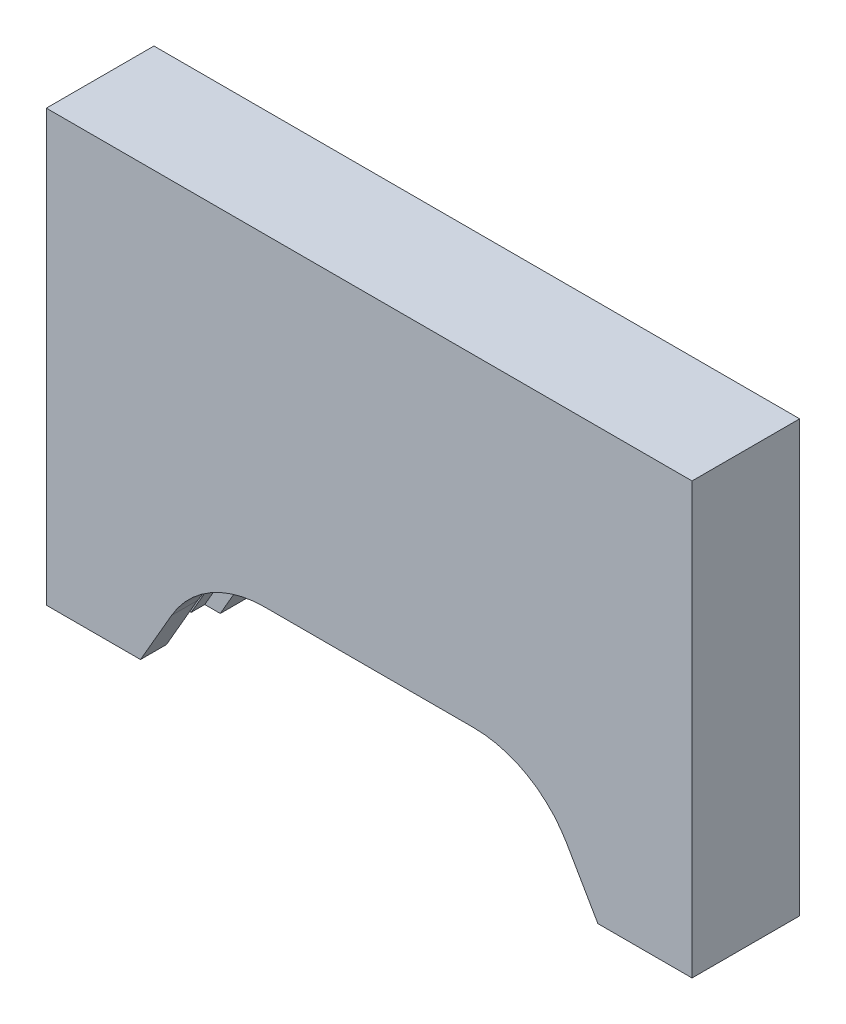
ISO-10303-21;
HEADER;
FILE_DESCRIPTION(('STEP AP214'),'2;1');
FILE_NAME('part.step','',(''),(''),'','','');
FILE_SCHEMA(('AUTOMOTIVE_DESIGN { 1 0 10303 214 1 1 1 1 }'));
ENDSEC;
DATA;
#1=APPLICATION_CONTEXT('core data for automotive mechanical design processes');
#2=APPLICATION_PROTOCOL_DEFINITION('international standard','automotive_design',2000,#1);
#3=PRODUCT_CONTEXT('',#1,'mechanical');
#4=PRODUCT('Part','Part','',(#3));
#5=PRODUCT_RELATED_PRODUCT_CATEGORY('part','',(#4));
#6=PRODUCT_DEFINITION_FORMATION('','',#4);
#7=PRODUCT_DEFINITION_CONTEXT('part definition',#1,'design');
#8=PRODUCT_DEFINITION('design','',#6,#7);
#9=PRODUCT_DEFINITION_SHAPE('','',#8);
#10=(LENGTH_UNIT() NAMED_UNIT(*) SI_UNIT(.MILLI.,.METRE.));
#11=(NAMED_UNIT(*) PLANE_ANGLE_UNIT() SI_UNIT($,.RADIAN.));
#12=(NAMED_UNIT(*) SI_UNIT($,.STERADIAN.) SOLID_ANGLE_UNIT());
#13=UNCERTAINTY_MEASURE_WITH_UNIT(LENGTH_MEASURE(1.E-05),#10,'distance_accuracy_value','');
#14=(GEOMETRIC_REPRESENTATION_CONTEXT(3) GLOBAL_UNCERTAINTY_ASSIGNED_CONTEXT((#13)) GLOBAL_UNIT_ASSIGNED_CONTEXT((#10,
#11,#12)) REPRESENTATION_CONTEXT('',''));
#15=CARTESIAN_POINT('',(0.,0.,0.));
#16=DIRECTION('',(0.,0.,1.));
#17=DIRECTION('',(1.,0.,0.));
#18=AXIS2_PLACEMENT_3D('',#15,#16,#17);
#19=CARTESIAN_POINT('',(-53.975,-50.8,288.293488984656));
#20=DIRECTION('',(-0.86602540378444,0.499999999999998,0.));
#21=DIRECTION('',(-0.499999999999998,-0.86602540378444,0.));
#22=AXIS2_PLACEMENT_3D('',#19,#20,#21);
#23=PLANE('',#22);
#24=DIRECTION('',(0.,0.,-1.));
#25=VECTOR('',#24,1.);
#26=CARTESIAN_POINT('',(-53.975,-50.8,288.293488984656));
#27=LINE('',#26,#25);
#28=CARTESIAN_POINT('',(-53.975,-50.8,25.4));
#29=VERTEX_POINT('',#28);
#30=CARTESIAN_POINT('',(-53.975,-50.8,19.2706454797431));
#31=VERTEX_POINT('',#30);
#32=EDGE_CURVE('E557',#29,#31,#27,.T.);
#33=ORIENTED_EDGE('',*,*,#32,.T.);
#34=DIRECTION('',(0.499999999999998,0.86602540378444,0.));
#35=VECTOR('',#34,1.);
#36=CARTESIAN_POINT('',(-53.975,-50.8,19.2706454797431));
#37=LINE('',#36,#35);
#38=CARTESIAN_POINT('',(-46.6426515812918,-38.1000000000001,19.2706454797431));
#39=VERTEX_POINT('',#38);
#40=EDGE_CURVE('E318',#31,#39,#37,.T.);
#41=ORIENTED_EDGE('',*,*,#40,.T.);
#42=DIRECTION('',(0.,0.,-1.));
#43=VECTOR('',#42,1.);
#44=CARTESIAN_POINT('',(-46.6426515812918,-38.1,288.293488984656));
#45=LINE('',#44,#43);
#46=CARTESIAN_POINT('',(-46.6426515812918,-38.1,25.4));
#47=VERTEX_POINT('',#46);
#48=EDGE_CURVE('E563',#47,#39,#45,.T.);
#49=ORIENTED_EDGE('',*,*,#48,.F.);
#50=DIRECTION('',(0.499999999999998,0.86602540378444,0.));
#51=VECTOR('',#50,1.);
#52=CARTESIAN_POINT('',(-18.4842047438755,10.6718605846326,25.4));
#53=LINE('',#52,#51);
#54=EDGE_CURVE('E63',#29,#47,#53,.T.);
#55=ORIENTED_EDGE('',*,*,#54,.F.);
#56=EDGE_LOOP('',(#33,#41,#49,#55));
#57=FACE_BOUND('',#56,.T.);
#58=ADVANCED_FACE('F39',(#57),#23,.F.);
#59=CARTESIAN_POINT('',(-24.645606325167,-50.8,288.293488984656));
#60=DIRECTION('',(0.,0.,-1.));
#61=DIRECTION('',(-1.,0.,0.));
#62=AXIS2_PLACEMENT_3D('',#59,#60,#61);
#63=CYLINDRICAL_SURFACE('',#62,25.4);
#64=ORIENTED_EDGE('',*,*,#48,.T.);
#65=CARTESIAN_POINT('',(-24.645606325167,-50.8,19.2706454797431));
#66=DIRECTION('',(0.,0.,1.));
#67=DIRECTION('',(1.,0.,0.));
#68=AXIS2_PLACEMENT_3D('',#65,#66,#67);
#69=CIRCLE('',#68,25.4);
#70=CARTESIAN_POINT('',(-24.6456063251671,-25.4,19.2706454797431));
#71=VERTEX_POINT('',#70);
#72=EDGE_CURVE('E791',#39,#71,#69,.F.);
#73=ORIENTED_EDGE('',*,*,#72,.T.);
#74=DIRECTION('',(0.,0.,-1.));
#75=VECTOR('',#74,1.);
#76=CARTESIAN_POINT('',(-24.645606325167,-25.4,288.293488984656));
#77=LINE('',#76,#75);
#78=CARTESIAN_POINT('',(-24.645606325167,-25.4,25.4));
#79=VERTEX_POINT('',#78);
#80=EDGE_CURVE('E583',#79,#71,#77,.T.);
#81=ORIENTED_EDGE('',*,*,#80,.F.);
#82=CARTESIAN_POINT('',(-24.645606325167,-50.8,25.4));
#83=DIRECTION('',(0.,0.,-1.));
#84=DIRECTION('',(-1.,0.,0.));
#85=AXIS2_PLACEMENT_3D('',#82,#83,#84);
#86=CIRCLE('',#85,25.4);
#87=EDGE_CURVE('E608',#47,#79,#86,.T.);
#88=ORIENTED_EDGE('',*,*,#87,.F.);
#89=EDGE_LOOP('',(#64,#73,#81,#88));
#90=FACE_BOUND('',#89,.T.);
#91=ADVANCED_FACE('F1075',(#90),#63,.F.);
#92=CARTESIAN_POINT('',(-24.645606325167,-25.4,288.293488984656));
#93=DIRECTION('',(0.,1.,0.));
#94=DIRECTION('',(0.,0.,1.));
#95=AXIS2_PLACEMENT_3D('',#92,#93,#94);
#96=PLANE('',#95);
#97=ORIENTED_EDGE('',*,*,#80,.T.);
#98=DIRECTION('',(1.,0.,0.));
#99=VECTOR('',#98,1.);
#100=CARTESIAN_POINT('',(-24.645606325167,-25.4,19.2706454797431));
#101=LINE('',#100,#99);
#102=CARTESIAN_POINT('',(24.645606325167,-25.4,19.2706454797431));
#103=VERTEX_POINT('',#102);
#104=EDGE_CURVE('E337',#71,#103,#101,.T.);
#105=ORIENTED_EDGE('',*,*,#104,.T.);
#106=DIRECTION('',(0.,0.,-1.));
#107=VECTOR('',#106,1.);
#108=CARTESIAN_POINT('',(24.645606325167,-25.4,288.293488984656));
#109=LINE('',#108,#107);
#110=CARTESIAN_POINT('',(24.645606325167,-25.4,25.4));
#111=VERTEX_POINT('',#110);
#112=EDGE_CURVE('E588',#111,#103,#109,.T.);
#113=ORIENTED_EDGE('',*,*,#112,.F.);
#114=DIRECTION('',(1.,0.,0.));
#115=VECTOR('',#114,1.);
#116=CARTESIAN_POINT('',(0.,-25.4,25.4));
#117=LINE('',#116,#115);
#118=EDGE_CURVE('E623',#79,#111,#117,.T.);
#119=ORIENTED_EDGE('',*,*,#118,.F.);
#120=EDGE_LOOP('',(#97,#105,#113,#119));
#121=FACE_BOUND('',#120,.T.);
#122=ADVANCED_FACE('F1085',(#121),#96,.F.);
#123=CARTESIAN_POINT('',(24.645606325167,-50.8,288.293488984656));
#124=DIRECTION('',(0.,0.,-1.));
#125=DIRECTION('',(-1.,0.,0.));
#126=AXIS2_PLACEMENT_3D('',#123,#124,#125);
#127=CYLINDRICAL_SURFACE('',#126,25.4);
#128=ORIENTED_EDGE('',*,*,#112,.T.);
#129=CARTESIAN_POINT('',(24.645606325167,-50.8,19.2706454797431));
#130=DIRECTION('',(0.,0.,1.));
#131=DIRECTION('',(1.,0.,0.));
#132=AXIS2_PLACEMENT_3D('',#129,#130,#131);
#133=CIRCLE('',#132,25.4);
#134=CARTESIAN_POINT('',(46.6426515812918,-38.1,19.2706454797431));
#135=VERTEX_POINT('',#134);
#136=EDGE_CURVE('E822',#103,#135,#133,.F.);
#137=ORIENTED_EDGE('',*,*,#136,.T.);
#138=DIRECTION('',(0.,0.,-1.));
#139=VECTOR('',#138,1.);
#140=CARTESIAN_POINT('',(46.6426515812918,-38.1,288.293488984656));
#141=LINE('',#140,#139);
#142=CARTESIAN_POINT('',(46.6426515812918,-38.1,25.4));
#143=VERTEX_POINT('',#142);
#144=EDGE_CURVE('E477',#143,#135,#141,.T.);
#145=ORIENTED_EDGE('',*,*,#144,.F.);
#146=CARTESIAN_POINT('',(24.645606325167,-50.8,25.4));
#147=DIRECTION('',(0.,0.,-1.));
#148=DIRECTION('',(-1.,0.,0.));
#149=AXIS2_PLACEMENT_3D('',#146,#147,#148);
#150=CIRCLE('',#149,25.4);
#151=EDGE_CURVE('E620',#111,#143,#150,.T.);
#152=ORIENTED_EDGE('',*,*,#151,.F.);
#153=EDGE_LOOP('',(#128,#137,#145,#152));
#154=FACE_BOUND('',#153,.T.);
#155=ADVANCED_FACE('F820',(#154),#127,.F.);
#156=CARTESIAN_POINT('',(46.6426515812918,-38.1,288.293488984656));
#157=DIRECTION('',(0.86602540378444,0.499999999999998,0.));
#158=DIRECTION('',(-0.499999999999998,0.86602540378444,0.));
#159=AXIS2_PLACEMENT_3D('',#156,#157,#158);
#160=PLANE('',#159);
#161=ORIENTED_EDGE('',*,*,#144,.T.);
#162=DIRECTION('',(0.499999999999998,-0.86602540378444,0.));
#163=VECTOR('',#162,1.);
#164=CARTESIAN_POINT('',(46.6426515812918,-38.1,19.2706454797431));
#165=LINE('',#164,#163);
#166=CARTESIAN_POINT('',(53.975,-50.8,19.2706454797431));
#167=VERTEX_POINT('',#166);
#168=EDGE_CURVE('E792',#135,#167,#165,.T.);
#169=ORIENTED_EDGE('',*,*,#168,.T.);
#170=DIRECTION('',(0.,0.,-1.));
#171=VECTOR('',#170,1.);
#172=CARTESIAN_POINT('',(53.975,-50.8,288.293488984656));
#173=LINE('',#172,#171);
#174=CARTESIAN_POINT('',(53.975,-50.8,25.4));
#175=VERTEX_POINT('',#174);
#176=EDGE_CURVE('E472',#175,#167,#173,.T.);
#177=ORIENTED_EDGE('',*,*,#176,.F.);
#178=DIRECTION('',(0.499999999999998,-0.86602540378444,0.));
#179=VECTOR('',#178,1.);
#180=CARTESIAN_POINT('',(18.4842047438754,10.6718605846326,25.4));
#181=LINE('',#180,#179);
#182=EDGE_CURVE('E561',#143,#175,#181,.T.);
#183=ORIENTED_EDGE('',*,*,#182,.F.);
#184=EDGE_LOOP('',(#161,#169,#177,#183));
#185=FACE_BOUND('',#184,.T.);
#186=ADVANCED_FACE('F816',(#185),#160,.F.);
#187=CARTESIAN_POINT('',(-76.2,-50.8,25.4));
#188=DIRECTION('',(0.,1.,0.));
#189=DIRECTION('',(0.,0.,1.));
#190=AXIS2_PLACEMENT_3D('',#187,#188,#189);
#191=PLANE('',#190);
#192=DIRECTION('',(0.,0.,1.));
#193=VECTOR('',#192,1.);
#194=CARTESIAN_POINT('',(-57.6411742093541,-50.8,25.4));
#195=LINE('',#194,#193);
#196=CARTESIAN_POINT('',(-57.6411742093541,-50.8,16.0956454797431));
#197=VERTEX_POINT('',#196);
#198=CARTESIAN_POINT('',(-57.6411742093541,-50.8,19.2706454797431));
#199=VERTEX_POINT('',#198);
#200=EDGE_CURVE('E12',#197,#199,#195,.T.);
#201=ORIENTED_EDGE('',*,*,#200,.T.);
#202=DIRECTION('',(1.,0.,0.));
#203=VECTOR('',#202,1.);
#204=CARTESIAN_POINT('',(-76.2,-50.8,19.2706454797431));
#205=LINE('',#204,#203);
#206=EDGE_CURVE('E323',#199,#31,#205,.T.);
#207=ORIENTED_EDGE('',*,*,#206,.T.);
#208=ORIENTED_EDGE('',*,*,#32,.F.);
#209=DIRECTION('',(1.,0.,0.));
#210=VECTOR('',#209,1.);
#211=CARTESIAN_POINT('',(-76.2,-50.8,25.4));
#212=LINE('',#211,#210);
#213=CARTESIAN_POINT('',(-76.2,-50.8,25.4));
#214=VERTEX_POINT('',#213);
#215=EDGE_CURVE('E628',#214,#29,#212,.T.);
#216=ORIENTED_EDGE('',*,*,#215,.F.);
#217=DIRECTION('',(0.,0.,-1.));
#218=VECTOR('',#217,1.);
#219=CARTESIAN_POINT('',(-76.2,-50.8,25.4));
#220=LINE('',#219,#218);
#221=CARTESIAN_POINT('',(-76.2,-50.8,0.));
#222=VERTEX_POINT('',#221);
#223=EDGE_CURVE('E666',#214,#222,#220,.T.);
#224=ORIENTED_EDGE('',*,*,#223,.T.);
#225=DIRECTION('',(1.,0.,0.));
#226=VECTOR('',#225,1.);
#227=CARTESIAN_POINT('',(-76.2,-50.8,0.));
#228=LINE('',#227,#226);
#229=CARTESIAN_POINT('',(-53.975,-50.8,0.));
#230=VERTEX_POINT('',#229);
#231=EDGE_CURVE('E538',#222,#230,#228,.T.);
#232=ORIENTED_EDGE('',*,*,#231,.T.);
#233=CARTESIAN_POINT('',(-53.975,-50.8,6.57064547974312));
#234=VERTEX_POINT('',#233);
#235=EDGE_CURVE('E562',#234,#230,#27,.T.);
#236=ORIENTED_EDGE('',*,*,#235,.F.);
#237=DIRECTION('',(-1.,0.,0.));
#238=VECTOR('',#237,1.);
#239=CARTESIAN_POINT('',(-76.2,-50.8,6.5706454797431));
#240=LINE('',#239,#238);
#241=CARTESIAN_POINT('',(-57.6411742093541,-50.8,6.5706454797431));
#242=VERTEX_POINT('',#241);
#243=EDGE_CURVE('E324',#234,#242,#240,.T.);
#244=ORIENTED_EDGE('',*,*,#243,.T.);
#245=DIRECTION('',(0.,0.,1.));
#246=VECTOR('',#245,1.);
#247=CARTESIAN_POINT('',(-57.6411742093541,-50.8,25.4));
#248=LINE('',#247,#246);
#249=CARTESIAN_POINT('',(-57.6411742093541,-50.8,9.7456454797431));
#250=VERTEX_POINT('',#249);
#251=EDGE_CURVE('E769',#242,#250,#248,.T.);
#252=ORIENTED_EDGE('',*,*,#251,.T.);
#253=CARTESIAN_POINT('',(-57.6411742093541,-50.8,12.9206454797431));
#254=DIRECTION('',(0.,1.,0.));
#255=DIRECTION('',(1.,0.,0.));
#256=AXIS2_PLACEMENT_3D('',#253,#254,#255);
#257=ELLIPSE('',#256,3.66617420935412,3.175);
#258=EDGE_CURVE('E48',#250,#197,#257,.T.);
#259=ORIENTED_EDGE('',*,*,#258,.T.);
#260=EDGE_LOOP('',(#201,#207,#208,#216,#224,#232,#236,#244,#252,#259));
#261=FACE_BOUND('',#260,.T.);
#262=ADVANCED_FACE('F779',(#261),#191,.F.);
#263=CARTESIAN_POINT('',(76.2,-50.8,25.4));
#264=DIRECTION('',(-1.,0.,0.));
#265=DIRECTION('',(0.,0.,1.));
#266=AXIS2_PLACEMENT_3D('',#263,#264,#265);
#267=PLANE('',#266);
#268=DIRECTION('',(0.,1.,0.));
#269=VECTOR('',#268,1.);
#270=CARTESIAN_POINT('',(76.2,-50.8,0.));
#271=LINE('',#270,#269);
#272=CARTESIAN_POINT('',(76.2,-50.8,0.));
#273=VERTEX_POINT('',#272);
#274=CARTESIAN_POINT('',(76.2,50.8,0.));
#275=VERTEX_POINT('',#274);
#276=EDGE_CURVE('E607',#273,#275,#271,.T.);
#277=ORIENTED_EDGE('',*,*,#276,.T.);
#278=DIRECTION('',(0.,0.,-1.));
#279=VECTOR('',#278,1.);
#280=CARTESIAN_POINT('',(76.2,50.8,25.4));
#281=LINE('',#280,#279);
#282=CARTESIAN_POINT('',(76.2,50.8,25.4));
#283=VERTEX_POINT('',#282);
#284=EDGE_CURVE('E520',#283,#275,#281,.T.);
#285=ORIENTED_EDGE('',*,*,#284,.F.);
#286=DIRECTION('',(0.,1.,0.));
#287=VECTOR('',#286,1.);
#288=CARTESIAN_POINT('',(76.2,-50.8,25.4));
#289=LINE('',#288,#287);
#290=CARTESIAN_POINT('',(76.2,-50.8,25.4));
#291=VERTEX_POINT('',#290);
#292=EDGE_CURVE('E542',#291,#283,#289,.T.);
#293=ORIENTED_EDGE('',*,*,#292,.F.);
#294=DIRECTION('',(0.,0.,-1.));
#295=VECTOR('',#294,1.);
#296=CARTESIAN_POINT('',(76.2,-50.8,25.4));
#297=LINE('',#296,#295);
#298=EDGE_CURVE('E547',#291,#273,#297,.T.);
#299=ORIENTED_EDGE('',*,*,#298,.T.);
#300=EDGE_LOOP('',(#277,#285,#293,#299));
#301=FACE_BOUND('',#300,.T.);
#302=ADVANCED_FACE('F41',(#301),#267,.F.);
#303=CARTESIAN_POINT('',(-76.2,50.8,25.4));
#304=DIRECTION('',(0.,-1.,0.));
#305=DIRECTION('',(0.,0.,-1.));
#306=AXIS2_PLACEMENT_3D('',#303,#304,#305);
#307=PLANE('',#306);
#308=DIRECTION('',(-1.,0.,0.));
#309=VECTOR('',#308,1.);
#310=CARTESIAN_POINT('',(-76.2,50.8,0.));
#311=LINE('',#310,#309);
#312=CARTESIAN_POINT('',(-76.2,50.8,0.));
#313=VERTEX_POINT('',#312);
#314=EDGE_CURVE('E639',#275,#313,#311,.T.);
#315=ORIENTED_EDGE('',*,*,#314,.T.);
#316=DIRECTION('',(0.,0.,-1.));
#317=VECTOR('',#316,1.);
#318=CARTESIAN_POINT('',(-76.2,50.8,25.4));
#319=LINE('',#318,#317);
#320=CARTESIAN_POINT('',(-76.2,50.8,25.4));
#321=VERTEX_POINT('',#320);
#322=EDGE_CURVE('E672',#321,#313,#319,.T.);
#323=ORIENTED_EDGE('',*,*,#322,.F.);
#324=DIRECTION('',(-1.,0.,0.));
#325=VECTOR('',#324,1.);
#326=CARTESIAN_POINT('',(-76.2,50.8,25.4));
#327=LINE('',#326,#325);
#328=EDGE_CURVE('E671',#283,#321,#327,.T.);
#329=ORIENTED_EDGE('',*,*,#328,.F.);
#330=ORIENTED_EDGE('',*,*,#284,.T.);
#331=EDGE_LOOP('',(#315,#323,#329,#330));
#332=FACE_BOUND('',#331,.T.);
#333=ADVANCED_FACE('F670',(#332),#307,.F.);
#334=CARTESIAN_POINT('',(-76.2,-50.8,25.4));
#335=DIRECTION('',(1.,0.,0.));
#336=DIRECTION('',(0.,0.,-1.));
#337=AXIS2_PLACEMENT_3D('',#334,#335,#336);
#338=PLANE('',#337);
#339=DIRECTION('',(0.,-1.,0.));
#340=VECTOR('',#339,1.);
#341=CARTESIAN_POINT('',(-76.2,-50.8,0.));
#342=LINE('',#341,#340);
#343=EDGE_CURVE('E544',#313,#222,#342,.T.);
#344=ORIENTED_EDGE('',*,*,#343,.T.);
#345=ORIENTED_EDGE('',*,*,#223,.F.);
#346=DIRECTION('',(0.,-1.,0.));
#347=VECTOR('',#346,1.);
#348=CARTESIAN_POINT('',(-76.2,-50.8,25.4));
#349=LINE('',#348,#347);
#350=EDGE_CURVE('E634',#321,#214,#349,.T.);
#351=ORIENTED_EDGE('',*,*,#350,.F.);
#352=ORIENTED_EDGE('',*,*,#322,.T.);
#353=EDGE_LOOP('',(#344,#345,#351,#352));
#354=FACE_BOUND('',#353,.T.);
#355=ADVANCED_FACE('F802',(#354),#338,.F.);
#356=ORIENTED_EDGE('',*,*,#176,.T.);
#357=DIRECTION('',(1.,0.,0.));
#358=VECTOR('',#357,1.);
#359=CARTESIAN_POINT('',(-76.2,-50.8,19.2706454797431));
#360=LINE('',#359,#358);
#361=CARTESIAN_POINT('',(57.6411742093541,-50.8,19.2706454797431));
#362=VERTEX_POINT('',#361);
#363=EDGE_CURVE('E828',#167,#362,#360,.T.);
#364=ORIENTED_EDGE('',*,*,#363,.T.);
#365=DIRECTION('',(0.,0.,-1.));
#366=VECTOR('',#365,1.);
#367=CARTESIAN_POINT('',(57.6411742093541,-50.8,25.4));
#368=LINE('',#367,#366);
#369=CARTESIAN_POINT('',(57.6411742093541,-50.8,16.0956454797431));
#370=VERTEX_POINT('',#369);
#371=EDGE_CURVE('E771',#362,#370,#368,.T.);
#372=ORIENTED_EDGE('',*,*,#371,.T.);
#373=CARTESIAN_POINT('',(57.6411742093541,-50.8,12.9206454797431));
#374=DIRECTION('',(0.,1.,0.));
#375=DIRECTION('',(1.,0.,0.));
#376=AXIS2_PLACEMENT_3D('',#373,#374,#375);
#377=ELLIPSE('',#376,3.66617420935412,3.175);
#378=CARTESIAN_POINT('',(57.6411742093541,-50.8,9.7456454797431));
#379=VERTEX_POINT('',#378);
#380=EDGE_CURVE('E837',#370,#379,#377,.T.);
#381=ORIENTED_EDGE('',*,*,#380,.T.);
#382=DIRECTION('',(0.,0.,-1.));
#383=VECTOR('',#382,1.);
#384=CARTESIAN_POINT('',(57.6411742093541,-50.8,25.4));
#385=LINE('',#384,#383);
#386=CARTESIAN_POINT('',(57.6411742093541,-50.8,6.5706454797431));
#387=VERTEX_POINT('',#386);
#388=EDGE_CURVE('E840',#379,#387,#385,.T.);
#389=ORIENTED_EDGE('',*,*,#388,.T.);
#390=DIRECTION('',(-1.,0.,0.));
#391=VECTOR('',#390,1.);
#392=CARTESIAN_POINT('',(-76.2,-50.8,6.57064547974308));
#393=LINE('',#392,#391);
#394=CARTESIAN_POINT('',(53.975,-50.8,6.57064547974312));
#395=VERTEX_POINT('',#394);
#396=EDGE_CURVE('E305',#387,#395,#393,.T.);
#397=ORIENTED_EDGE('',*,*,#396,.T.);
#398=CARTESIAN_POINT('',(53.975,-50.8,0.));
#399=VERTEX_POINT('',#398);
#400=EDGE_CURVE('E476',#395,#399,#173,.T.);
#401=ORIENTED_EDGE('',*,*,#400,.T.);
#402=EDGE_CURVE('E543',#399,#273,#228,.T.);
#403=ORIENTED_EDGE('',*,*,#402,.T.);
#404=ORIENTED_EDGE('',*,*,#298,.F.);
#405=EDGE_CURVE('E633',#175,#291,#212,.T.);
#406=ORIENTED_EDGE('',*,*,#405,.F.);
#407=EDGE_LOOP('',(#356,#364,#372,#381,#389,#397,#401,#403,#404,#406));
#408=FACE_BOUND('',#407,.T.);
#409=ADVANCED_FACE('F655',(#408),#191,.F.);
#410=CARTESIAN_POINT('',(0.,0.,25.4));
#411=DIRECTION('',(0.,0.,-1.));
#412=DIRECTION('',(-1.,0.,0.));
#413=AXIS2_PLACEMENT_3D('',#410,#411,#412);
#414=PLANE('',#413);
#415=ORIENTED_EDGE('',*,*,#215,.T.);
#416=ORIENTED_EDGE('',*,*,#54,.T.);
#417=ORIENTED_EDGE('',*,*,#87,.T.);
#418=ORIENTED_EDGE('',*,*,#118,.T.);
#419=ORIENTED_EDGE('',*,*,#151,.T.);
#420=ORIENTED_EDGE('',*,*,#182,.T.);
#421=ORIENTED_EDGE('',*,*,#405,.T.);
#422=ORIENTED_EDGE('',*,*,#292,.T.);
#423=ORIENTED_EDGE('',*,*,#328,.T.);
#424=ORIENTED_EDGE('',*,*,#350,.T.);
#425=EDGE_LOOP('',(#415,#416,#417,#418,#419,#420,#421,#422,#423,#424));
#426=FACE_BOUND('',#425,.T.);
#427=ADVANCED_FACE('F683',(#426),#414,.F.);
#428=CARTESIAN_POINT('',(0.,0.,0.));
#429=DIRECTION('',(0.,0.,-1.));
#430=DIRECTION('',(-1.,0.,0.));
#431=AXIS2_PLACEMENT_3D('',#428,#429,#430);
#432=PLANE('',#431);
#433=DIRECTION('',(0.499999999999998,0.86602540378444,0.));
#434=VECTOR('',#433,1.);
#435=CARTESIAN_POINT('',(-18.4842047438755,10.6718605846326,0.));
#436=LINE('',#435,#434);
#437=CARTESIAN_POINT('',(-46.6426515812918,-38.1,0.));
#438=VERTEX_POINT('',#437);
#439=EDGE_CURVE('E498',#230,#438,#436,.T.);
#440=ORIENTED_EDGE('',*,*,#439,.F.);
#441=ORIENTED_EDGE('',*,*,#231,.F.);
#442=ORIENTED_EDGE('',*,*,#343,.F.);
#443=ORIENTED_EDGE('',*,*,#314,.F.);
#444=ORIENTED_EDGE('',*,*,#276,.F.);
#445=ORIENTED_EDGE('',*,*,#402,.F.);
#446=DIRECTION('',(0.499999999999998,-0.86602540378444,0.));
#447=VECTOR('',#446,1.);
#448=CARTESIAN_POINT('',(18.4842047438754,10.6718605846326,0.));
#449=LINE('',#448,#447);
#450=CARTESIAN_POINT('',(46.6426515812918,-38.1,0.));
#451=VERTEX_POINT('',#450);
#452=EDGE_CURVE('E513',#451,#399,#449,.T.);
#453=ORIENTED_EDGE('',*,*,#452,.F.);
#454=CARTESIAN_POINT('',(24.645606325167,-50.8,0.));
#455=DIRECTION('',(0.,0.,-1.));
#456=DIRECTION('',(-1.,0.,0.));
#457=AXIS2_PLACEMENT_3D('',#454,#455,#456);
#458=CIRCLE('',#457,25.4);
#459=CARTESIAN_POINT('',(24.645606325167,-25.4,0.));
#460=VERTEX_POINT('',#459);
#461=EDGE_CURVE('E519',#460,#451,#458,.T.);
#462=ORIENTED_EDGE('',*,*,#461,.F.);
#463=DIRECTION('',(1.,0.,0.));
#464=VECTOR('',#463,1.);
#465=CARTESIAN_POINT('',(0.,-25.4,0.));
#466=LINE('',#465,#464);
#467=CARTESIAN_POINT('',(-24.645606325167,-25.4,0.));
#468=VERTEX_POINT('',#467);
#469=EDGE_CURVE('E526',#468,#460,#466,.T.);
#470=ORIENTED_EDGE('',*,*,#469,.F.);
#471=CARTESIAN_POINT('',(-24.645606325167,-50.8,0.));
#472=DIRECTION('',(0.,0.,-1.));
#473=DIRECTION('',(-1.,0.,0.));
#474=AXIS2_PLACEMENT_3D('',#471,#472,#473);
#475=CIRCLE('',#474,25.4);
#476=EDGE_CURVE('E504',#438,#468,#475,.T.);
#477=ORIENTED_EDGE('',*,*,#476,.F.);
#478=EDGE_LOOP('',(#440,#441,#442,#443,#444,#445,#453,#462,#470,#477));
#479=FACE_BOUND('',#478,.T.);
#480=ADVANCED_FACE('F668',(#479),#432,.T.);
#481=CARTESIAN_POINT('',(-46.6426515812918,-38.1000000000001,6.57064547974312));
#482=VERTEX_POINT('',#481);
#483=EDGE_CURVE('E586',#482,#438,#45,.T.);
#484=ORIENTED_EDGE('',*,*,#483,.F.);
#485=DIRECTION('',(-0.499999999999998,-0.86602540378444,0.));
#486=VECTOR('',#485,1.);
#487=CARTESIAN_POINT('',(-53.975,-50.8,6.57064547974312));
#488=LINE('',#487,#486);
#489=EDGE_CURVE('E342',#482,#234,#488,.T.);
#490=ORIENTED_EDGE('',*,*,#489,.T.);
#491=ORIENTED_EDGE('',*,*,#235,.T.);
#492=ORIENTED_EDGE('',*,*,#439,.T.);
#493=EDGE_LOOP('',(#484,#490,#491,#492));
#494=FACE_BOUND('',#493,.T.);
#495=ADVANCED_FACE('F795',(#494),#23,.F.);
#496=CARTESIAN_POINT('',(-24.6456063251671,-25.4,6.5706454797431));
#497=VERTEX_POINT('',#496);
#498=EDGE_CURVE('E587',#497,#468,#77,.T.);
#499=ORIENTED_EDGE('',*,*,#498,.F.);
#500=CARTESIAN_POINT('',(-24.645606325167,-50.8,6.57064547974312));
#501=DIRECTION('',(0.,0.,-1.));
#502=DIRECTION('',(-1.,0.,0.));
#503=AXIS2_PLACEMENT_3D('',#500,#501,#502);
#504=CIRCLE('',#503,25.4);
#505=EDGE_CURVE('E712',#497,#482,#504,.F.);
#506=ORIENTED_EDGE('',*,*,#505,.T.);
#507=ORIENTED_EDGE('',*,*,#483,.T.);
#508=ORIENTED_EDGE('',*,*,#476,.T.);
#509=EDGE_LOOP('',(#499,#506,#507,#508));
#510=FACE_BOUND('',#509,.T.);
#511=ADVANCED_FACE('F788',(#510),#63,.F.);
#512=CARTESIAN_POINT('',(24.645606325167,-25.4,6.57064547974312));
#513=VERTEX_POINT('',#512);
#514=EDGE_CURVE('E475',#513,#460,#109,.T.);
#515=ORIENTED_EDGE('',*,*,#514,.F.);
#516=DIRECTION('',(-1.,0.,0.));
#517=VECTOR('',#516,1.);
#518=CARTESIAN_POINT('',(-24.645606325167,-25.4,6.57064547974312));
#519=LINE('',#518,#517);
#520=EDGE_CURVE('E343',#513,#497,#519,.T.);
#521=ORIENTED_EDGE('',*,*,#520,.T.);
#522=ORIENTED_EDGE('',*,*,#498,.T.);
#523=ORIENTED_EDGE('',*,*,#469,.T.);
#524=EDGE_LOOP('',(#515,#521,#522,#523));
#525=FACE_BOUND('',#524,.T.);
#526=ADVANCED_FACE('F854',(#525),#96,.F.);
#527=CARTESIAN_POINT('',(46.6426515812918,-38.1,6.57064547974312));
#528=VERTEX_POINT('',#527);
#529=EDGE_CURVE('E808',#528,#451,#141,.T.);
#530=ORIENTED_EDGE('',*,*,#529,.F.);
#531=CARTESIAN_POINT('',(24.645606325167,-50.8,6.57064547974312));
#532=DIRECTION('',(0.,0.,-1.));
#533=DIRECTION('',(-1.,0.,0.));
#534=AXIS2_PLACEMENT_3D('',#531,#532,#533);
#535=CIRCLE('',#534,25.4);
#536=EDGE_CURVE('E826',#528,#513,#535,.F.);
#537=ORIENTED_EDGE('',*,*,#536,.T.);
#538=ORIENTED_EDGE('',*,*,#514,.T.);
#539=ORIENTED_EDGE('',*,*,#461,.T.);
#540=EDGE_LOOP('',(#530,#537,#538,#539));
#541=FACE_BOUND('',#540,.T.);
#542=ADVANCED_FACE('F849',(#541),#127,.F.);
#543=ORIENTED_EDGE('',*,*,#400,.F.);
#544=DIRECTION('',(-0.499999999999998,0.86602540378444,0.));
#545=VECTOR('',#544,1.);
#546=CARTESIAN_POINT('',(46.6426515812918,-38.1,6.57064547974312));
#547=LINE('',#546,#545);
#548=EDGE_CURVE('E503',#395,#528,#547,.T.);
#549=ORIENTED_EDGE('',*,*,#548,.T.);
#550=ORIENTED_EDGE('',*,*,#529,.T.);
#551=ORIENTED_EDGE('',*,*,#452,.T.);
#552=EDGE_LOOP('',(#543,#549,#550,#551));
#553=FACE_BOUND('',#552,.T.);
#554=ADVANCED_FACE('F847',(#553),#160,.F.);
#555=CARTESIAN_POINT('',(-64.9735226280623,-63.5,12.9206454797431));
#556=DIRECTION('',(0.499999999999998,0.86602540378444,0.));
#557=DIRECTION('',(-0.86602540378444,0.499999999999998,0.));
#558=AXIS2_PLACEMENT_3D('',#555,#556,#557);
#559=CYLINDRICAL_SURFACE('',#558,3.175);
#560=DIRECTION('',(0.499999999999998,0.86602540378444,0.));
#561=VECTOR('',#560,1.);
#562=CARTESIAN_POINT('',(-64.9735226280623,-63.5,9.7456454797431));
#563=LINE('',#562,#561);
#564=CARTESIAN_POINT('',(-49.3922822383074,-36.5125000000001,9.7456454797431));
#565=VERTEX_POINT('',#564);
#566=EDGE_CURVE('E226',#250,#565,#563,.T.);
#567=ORIENTED_EDGE('',*,*,#566,.T.);
#568=CARTESIAN_POINT('',(-49.3922822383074,-36.5125000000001,12.9206454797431));
#569=DIRECTION('',(0.499999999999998,0.86602540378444,0.));
#570=DIRECTION('',(-0.86602540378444,0.499999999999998,0.));
#571=AXIS2_PLACEMENT_3D('',#568,#569,#570);
#572=CIRCLE('',#571,3.175);
#573=CARTESIAN_POINT('',(-49.3922822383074,-36.5125000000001,16.0956454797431));
#574=VERTEX_POINT('',#573);
#575=EDGE_CURVE('E231',#565,#574,#572,.T.);
#576=ORIENTED_EDGE('',*,*,#575,.T.);
#577=DIRECTION('',(0.499999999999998,0.86602540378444,0.));
#578=VECTOR('',#577,1.);
#579=CARTESIAN_POINT('',(-64.9735226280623,-63.5,16.0956454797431));
#580=LINE('',#579,#578);
#581=EDGE_CURVE('E262',#197,#574,#580,.T.);
#582=ORIENTED_EDGE('',*,*,#581,.F.);
#583=ORIENTED_EDGE('',*,*,#258,.F.);
#584=EDGE_LOOP('',(#567,#576,#582,#583));
#585=FACE_BOUND('',#584,.T.);
#586=ADVANCED_FACE('F228',(#585),#559,.F.);
#587=CARTESIAN_POINT('',(-64.9735226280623,-63.5,16.0956454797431));
#588=DIRECTION('',(-0.86602540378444,0.499999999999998,0.));
#589=DIRECTION('',(-0.499999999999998,-0.86602540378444,0.));
#590=AXIS2_PLACEMENT_3D('',#587,#588,#589);
#591=PLANE('',#590);
#592=ORIENTED_EDGE('',*,*,#581,.T.);
#593=DIRECTION('',(0.,0.,1.));
#594=VECTOR('',#593,1.);
#595=CARTESIAN_POINT('',(-49.3922822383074,-36.5125000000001,16.0956454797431));
#596=LINE('',#595,#594);
#597=CARTESIAN_POINT('',(-49.3922822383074,-36.5125000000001,19.2706454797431));
#598=VERTEX_POINT('',#597);
#599=EDGE_CURVE('E264',#574,#598,#596,.T.);
#600=ORIENTED_EDGE('',*,*,#599,.T.);
#601=DIRECTION('',(0.499999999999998,0.86602540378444,0.));
#602=VECTOR('',#601,1.);
#603=CARTESIAN_POINT('',(-64.9735226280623,-63.5,19.2706454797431));
#604=LINE('',#603,#602);
#605=EDGE_CURVE('E280',#199,#598,#604,.T.);
#606=ORIENTED_EDGE('',*,*,#605,.F.);
#607=ORIENTED_EDGE('',*,*,#200,.F.);
#608=EDGE_LOOP('',(#592,#600,#606,#607));
#609=FACE_BOUND('',#608,.T.);
#610=ADVANCED_FACE('F878',(#609),#591,.F.);
#611=CARTESIAN_POINT('',(-64.9735226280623,-63.5,6.5706454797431));
#612=DIRECTION('',(-0.86602540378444,0.499999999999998,0.));
#613=DIRECTION('',(-0.499999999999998,-0.86602540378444,0.));
#614=AXIS2_PLACEMENT_3D('',#611,#612,#613);
#615=PLANE('',#614);
#616=DIRECTION('',(0.499999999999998,0.86602540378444,0.));
#617=VECTOR('',#616,1.);
#618=CARTESIAN_POINT('',(-64.9735226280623,-63.5,6.5706454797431));
#619=LINE('',#618,#617);
#620=CARTESIAN_POINT('',(-49.3922822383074,-36.5125000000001,6.5706454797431));
#621=VERTEX_POINT('',#620);
#622=EDGE_CURVE('E254',#242,#621,#619,.T.);
#623=ORIENTED_EDGE('',*,*,#622,.T.);
#624=DIRECTION('',(0.,0.,1.));
#625=VECTOR('',#624,1.);
#626=CARTESIAN_POINT('',(-49.3922822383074,-36.5125000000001,6.5706454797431));
#627=LINE('',#626,#625);
#628=EDGE_CURVE('E244',#621,#565,#627,.T.);
#629=ORIENTED_EDGE('',*,*,#628,.T.);
#630=ORIENTED_EDGE('',*,*,#566,.F.);
#631=ORIENTED_EDGE('',*,*,#251,.F.);
#632=EDGE_LOOP('',(#623,#629,#630,#631));
#633=FACE_BOUND('',#632,.T.);
#634=ADVANCED_FACE('F252',(#633),#615,.F.);
#635=CARTESIAN_POINT('',(49.3922822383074,-36.5125,12.9206454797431));
#636=DIRECTION('',(0.499999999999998,-0.86602540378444,0.));
#637=DIRECTION('',(0.86602540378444,0.499999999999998,0.));
#638=AXIS2_PLACEMENT_3D('',#635,#636,#637);
#639=CYLINDRICAL_SURFACE('',#638,3.175);
#640=DIRECTION('',(0.499999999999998,-0.86602540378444,0.));
#641=VECTOR('',#640,1.);
#642=CARTESIAN_POINT('',(49.3922822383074,-36.5125,16.0956454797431));
#643=LINE('',#642,#641);
#644=CARTESIAN_POINT('',(49.3922822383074,-36.5125,16.0956454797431));
#645=VERTEX_POINT('',#644);
#646=EDGE_CURVE('E450',#645,#370,#643,.T.);
#647=ORIENTED_EDGE('',*,*,#646,.F.);
#648=CARTESIAN_POINT('',(49.3922822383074,-36.5125,12.9206454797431));
#649=DIRECTION('',(0.499999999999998,-0.86602540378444,0.));
#650=DIRECTION('',(0.86602540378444,0.499999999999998,0.));
#651=AXIS2_PLACEMENT_3D('',#648,#649,#650);
#652=CIRCLE('',#651,3.175);
#653=CARTESIAN_POINT('',(49.3922822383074,-36.5125,9.7456454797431));
#654=VERTEX_POINT('',#653);
#655=EDGE_CURVE('E448',#654,#645,#652,.T.);
#656=ORIENTED_EDGE('',*,*,#655,.F.);
#657=DIRECTION('',(0.499999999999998,-0.86602540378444,0.));
#658=VECTOR('',#657,1.);
#659=CARTESIAN_POINT('',(49.3922822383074,-36.5125,9.7456454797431));
#660=LINE('',#659,#658);
#661=EDGE_CURVE('E281',#654,#379,#660,.T.);
#662=ORIENTED_EDGE('',*,*,#661,.T.);
#663=ORIENTED_EDGE('',*,*,#380,.F.);
#664=EDGE_LOOP('',(#647,#656,#662,#663));
#665=FACE_BOUND('',#664,.T.);
#666=ADVANCED_FACE('F1020',(#665),#639,.F.);
#667=CARTESIAN_POINT('',(49.3922822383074,-36.5125,16.0956454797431));
#668=DIRECTION('',(0.86602540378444,0.499999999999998,0.));
#669=DIRECTION('',(-0.499999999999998,0.86602540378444,0.));
#670=AXIS2_PLACEMENT_3D('',#667,#668,#669);
#671=PLANE('',#670);
#672=DIRECTION('',(0.499999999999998,-0.86602540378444,0.));
#673=VECTOR('',#672,1.);
#674=CARTESIAN_POINT('',(49.3922822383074,-36.5125,19.2706454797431));
#675=LINE('',#674,#673);
#676=CARTESIAN_POINT('',(49.3922822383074,-36.5125,19.2706454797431));
#677=VERTEX_POINT('',#676);
#678=EDGE_CURVE('E367',#677,#362,#675,.T.);
#679=ORIENTED_EDGE('',*,*,#678,.F.);
#680=DIRECTION('',(0.,0.,1.));
#681=VECTOR('',#680,1.);
#682=CARTESIAN_POINT('',(49.3922822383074,-36.5125,16.0956454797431));
#683=LINE('',#682,#681);
#684=EDGE_CURVE('E416',#645,#677,#683,.T.);
#685=ORIENTED_EDGE('',*,*,#684,.F.);
#686=ORIENTED_EDGE('',*,*,#646,.T.);
#687=ORIENTED_EDGE('',*,*,#371,.F.);
#688=EDGE_LOOP('',(#679,#685,#686,#687));
#689=FACE_BOUND('',#688,.T.);
#690=ADVANCED_FACE('F1030',(#689),#671,.F.);
#691=CARTESIAN_POINT('',(49.3922822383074,-36.5125,6.5706454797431));
#692=DIRECTION('',(0.86602540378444,0.499999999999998,0.));
#693=DIRECTION('',(-0.499999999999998,0.86602540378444,0.));
#694=AXIS2_PLACEMENT_3D('',#691,#692,#693);
#695=PLANE('',#694);
#696=ORIENTED_EDGE('',*,*,#661,.F.);
#697=DIRECTION('',(0.,0.,1.));
#698=VECTOR('',#697,1.);
#699=CARTESIAN_POINT('',(49.3922822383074,-36.5125,6.5706454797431));
#700=LINE('',#699,#698);
#701=CARTESIAN_POINT('',(49.3922822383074,-36.5125,6.5706454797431));
#702=VERTEX_POINT('',#701);
#703=EDGE_CURVE('E297',#702,#654,#700,.T.);
#704=ORIENTED_EDGE('',*,*,#703,.F.);
#705=DIRECTION('',(0.499999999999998,-0.86602540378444,0.));
#706=VECTOR('',#705,1.);
#707=CARTESIAN_POINT('',(49.3922822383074,-36.5125,6.5706454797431));
#708=LINE('',#707,#706);
#709=EDGE_CURVE('E694',#702,#387,#708,.T.);
#710=ORIENTED_EDGE('',*,*,#709,.T.);
#711=ORIENTED_EDGE('',*,*,#388,.F.);
#712=EDGE_LOOP('',(#696,#704,#710,#711));
#713=FACE_BOUND('',#712,.T.);
#714=ADVANCED_FACE('F884',(#713),#695,.F.);
#715=CARTESIAN_POINT('',(-64.9735226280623,-63.5,19.2706454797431));
#716=DIRECTION('',(0.,0.,1.));
#717=DIRECTION('',(1.,0.,0.));
#718=AXIS2_PLACEMENT_3D('',#715,#716,#717);
#719=PLANE('',#718);
#720=ORIENTED_EDGE('',*,*,#605,.T.);
#721=DIRECTION('',(0.86602540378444,-0.499999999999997,0.));
#722=VECTOR('',#721,1.);
#723=CARTESIAN_POINT('',(-49.3922822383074,-36.5125000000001,19.2706454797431));
#724=LINE('',#723,#722);
#725=EDGE_CURVE('E361',#598,#39,#724,.T.);
#726=ORIENTED_EDGE('',*,*,#725,.T.);
#727=ORIENTED_EDGE('',*,*,#40,.F.);
#728=ORIENTED_EDGE('',*,*,#206,.F.);
#729=EDGE_LOOP('',(#720,#726,#727,#728));
#730=FACE_BOUND('',#729,.T.);
#731=ADVANCED_FACE('F805',(#730),#719,.F.);
#732=CARTESIAN_POINT('',(-59.4742613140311,-66.675,6.5706454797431));
#733=DIRECTION('',(0.,0.,-1.));
#734=DIRECTION('',(-1.,0.,0.));
#735=AXIS2_PLACEMENT_3D('',#732,#733,#734);
#736=PLANE('',#735);
#737=ORIENTED_EDGE('',*,*,#489,.F.);
#738=DIRECTION('',(-0.86602540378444,0.499999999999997,0.));
#739=VECTOR('',#738,1.);
#740=CARTESIAN_POINT('',(-43.8930209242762,-39.6875,6.5706454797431));
#741=LINE('',#740,#739);
#742=EDGE_CURVE('E366',#482,#621,#741,.T.);
#743=ORIENTED_EDGE('',*,*,#742,.T.);
#744=ORIENTED_EDGE('',*,*,#622,.F.);
#745=ORIENTED_EDGE('',*,*,#243,.F.);
#746=EDGE_LOOP('',(#737,#743,#744,#745));
#747=FACE_BOUND('',#746,.T.);
#748=ADVANCED_FACE('F784',(#747),#736,.F.);
#749=CARTESIAN_POINT('',(-49.3922822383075,-36.5125,19.2706454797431));
#750=DIRECTION('',(0.,0.,1.));
#751=DIRECTION('',(1.,0.,0.));
#752=AXIS2_PLACEMENT_3D('',#749,#750,#751);
#753=PLANE('',#752);
#754=ORIENTED_EDGE('',*,*,#725,.F.);
#755=CARTESIAN_POINT('',(-24.645606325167,-50.8,19.2706454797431));
#756=DIRECTION('',(0.,0.,-1.));
#757=DIRECTION('',(-0.86602540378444,0.499999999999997,0.));
#758=AXIS2_PLACEMENT_3D('',#755,#756,#757);
#759=CIRCLE('',#758,28.575);
#760=CARTESIAN_POINT('',(-24.6456063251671,-22.225,19.2706454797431));
#761=VERTEX_POINT('',#760);
#762=EDGE_CURVE('E374',#598,#761,#759,.T.);
#763=ORIENTED_EDGE('',*,*,#762,.T.);
#764=DIRECTION('',(0.,-1.,0.));
#765=VECTOR('',#764,1.);
#766=CARTESIAN_POINT('',(-24.6456063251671,-22.225,19.2706454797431));
#767=LINE('',#766,#765);
#768=EDGE_CURVE('E369',#761,#71,#767,.T.);
#769=ORIENTED_EDGE('',*,*,#768,.T.);
#770=ORIENTED_EDGE('',*,*,#72,.F.);
#771=EDGE_LOOP('',(#754,#763,#769,#770));
#772=FACE_BOUND('',#771,.T.);
#773=ADVANCED_FACE('F875',(#772),#753,.F.);
#774=CARTESIAN_POINT('',(-43.8930209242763,-39.6875,6.5706454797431));
#775=DIRECTION('',(0.,0.,-1.));
#776=DIRECTION('',(-1.,0.,0.));
#777=AXIS2_PLACEMENT_3D('',#774,#775,#776);
#778=PLANE('',#777);
#779=DIRECTION('',(0.,1.,0.));
#780=VECTOR('',#779,1.);
#781=CARTESIAN_POINT('',(-24.6456063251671,-28.575,6.5706454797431));
#782=LINE('',#781,#780);
#783=CARTESIAN_POINT('',(-24.6456063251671,-22.225,6.5706454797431));
#784=VERTEX_POINT('',#783);
#785=EDGE_CURVE('E373',#497,#784,#782,.T.);
#786=ORIENTED_EDGE('',*,*,#785,.T.);
#787=CARTESIAN_POINT('',(-24.645606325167,-50.8,6.5706454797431));
#788=DIRECTION('',(0.,0.,-1.));
#789=DIRECTION('',(-0.86602540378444,0.499999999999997,0.));
#790=AXIS2_PLACEMENT_3D('',#787,#788,#789);
#791=CIRCLE('',#790,28.575);
#792=EDGE_CURVE('E386',#621,#784,#791,.T.);
#793=ORIENTED_EDGE('',*,*,#792,.F.);
#794=ORIENTED_EDGE('',*,*,#742,.F.);
#795=ORIENTED_EDGE('',*,*,#505,.F.);
#796=EDGE_LOOP('',(#786,#793,#794,#795));
#797=FACE_BOUND('',#796,.T.);
#798=ADVANCED_FACE('F709',(#797),#778,.F.);
#799=CARTESIAN_POINT('',(-24.645606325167,-22.225,19.2706454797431));
#800=DIRECTION('',(0.,0.,1.));
#801=DIRECTION('',(1.,0.,0.));
#802=AXIS2_PLACEMENT_3D('',#799,#800,#801);
#803=PLANE('',#802);
#804=ORIENTED_EDGE('',*,*,#768,.F.);
#805=DIRECTION('',(1.,0.,0.));
#806=VECTOR('',#805,1.);
#807=CARTESIAN_POINT('',(-24.645606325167,-22.225,19.2706454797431));
#808=LINE('',#807,#806);
#809=CARTESIAN_POINT('',(24.645606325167,-22.225,19.2706454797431));
#810=VERTEX_POINT('',#809);
#811=EDGE_CURVE('E421',#761,#810,#808,.T.);
#812=ORIENTED_EDGE('',*,*,#811,.T.);
#813=DIRECTION('',(0.,-1.,0.));
#814=VECTOR('',#813,1.);
#815=CARTESIAN_POINT('',(24.645606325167,-22.225,19.2706454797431));
#816=LINE('',#815,#814);
#817=EDGE_CURVE('E375',#810,#103,#816,.T.);
#818=ORIENTED_EDGE('',*,*,#817,.T.);
#819=ORIENTED_EDGE('',*,*,#104,.F.);
#820=EDGE_LOOP('',(#804,#812,#818,#819));
#821=FACE_BOUND('',#820,.T.);
#822=ADVANCED_FACE('F873',(#821),#803,.F.);
#823=CARTESIAN_POINT('',(-24.645606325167,-28.575,6.5706454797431));
#824=DIRECTION('',(0.,0.,-1.));
#825=DIRECTION('',(0.,1.,0.));
#826=AXIS2_PLACEMENT_3D('',#823,#824,#825);
#827=PLANE('',#826);
#828=DIRECTION('',(0.,1.,0.));
#829=VECTOR('',#828,1.);
#830=CARTESIAN_POINT('',(24.645606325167,-28.575,6.5706454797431));
#831=LINE('',#830,#829);
#832=CARTESIAN_POINT('',(24.645606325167,-22.225,6.5706454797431));
#833=VERTEX_POINT('',#832);
#834=EDGE_CURVE('E382',#513,#833,#831,.T.);
#835=ORIENTED_EDGE('',*,*,#834,.T.);
#836=DIRECTION('',(1.,0.,0.));
#837=VECTOR('',#836,1.);
#838=CARTESIAN_POINT('',(-24.645606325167,-22.225,6.5706454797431));
#839=LINE('',#838,#837);
#840=EDGE_CURVE('E385',#784,#833,#839,.T.);
#841=ORIENTED_EDGE('',*,*,#840,.F.);
#842=ORIENTED_EDGE('',*,*,#785,.F.);
#843=ORIENTED_EDGE('',*,*,#520,.F.);
#844=EDGE_LOOP('',(#835,#841,#842,#843));
#845=FACE_BOUND('',#844,.T.);
#846=ADVANCED_FACE('F715',(#845),#827,.F.);
#847=CARTESIAN_POINT('',(24.645606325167,-22.225,19.2706454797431));
#848=DIRECTION('',(0.,0.,1.));
#849=DIRECTION('',(1.,0.,0.));
#850=AXIS2_PLACEMENT_3D('',#847,#848,#849);
#851=PLANE('',#850);
#852=ORIENTED_EDGE('',*,*,#817,.F.);
#853=CARTESIAN_POINT('',(24.645606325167,-50.8,19.2706454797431));
#854=DIRECTION('',(0.,0.,-1.));
#855=DIRECTION('',(0.,1.,0.));
#856=AXIS2_PLACEMENT_3D('',#853,#854,#855);
#857=CIRCLE('',#856,28.575);
#858=EDGE_CURVE('E409',#810,#677,#857,.T.);
#859=ORIENTED_EDGE('',*,*,#858,.T.);
#860=DIRECTION('',(-0.866025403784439,-0.499999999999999,0.));
#861=VECTOR('',#860,1.);
#862=CARTESIAN_POINT('',(49.3922822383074,-36.5125,19.2706454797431));
#863=LINE('',#862,#861);
#864=EDGE_CURVE('E405',#677,#135,#863,.T.);
#865=ORIENTED_EDGE('',*,*,#864,.T.);
#866=ORIENTED_EDGE('',*,*,#136,.F.);
#867=EDGE_LOOP('',(#852,#859,#865,#866));
#868=FACE_BOUND('',#867,.T.);
#869=ADVANCED_FACE('F929',(#868),#851,.F.);
#870=CARTESIAN_POINT('',(24.645606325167,-28.575,6.5706454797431));
#871=DIRECTION('',(0.,0.,-1.));
#872=DIRECTION('',(-1.,0.,0.));
#873=AXIS2_PLACEMENT_3D('',#870,#871,#872);
#874=PLANE('',#873);
#875=DIRECTION('',(0.866025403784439,0.499999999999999,0.));
#876=VECTOR('',#875,1.);
#877=CARTESIAN_POINT('',(43.8930209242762,-39.6875,6.5706454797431));
#878=LINE('',#877,#876);
#879=EDGE_CURVE('E55',#528,#702,#878,.T.);
#880=ORIENTED_EDGE('',*,*,#879,.T.);
#881=CARTESIAN_POINT('',(24.645606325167,-50.8,6.5706454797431));
#882=DIRECTION('',(0.,0.,-1.));
#883=DIRECTION('',(0.,1.,0.));
#884=AXIS2_PLACEMENT_3D('',#881,#882,#883);
#885=CIRCLE('',#884,28.575);
#886=EDGE_CURVE('E302',#833,#702,#885,.T.);
#887=ORIENTED_EDGE('',*,*,#886,.F.);
#888=ORIENTED_EDGE('',*,*,#834,.F.);
#889=ORIENTED_EDGE('',*,*,#536,.F.);
#890=EDGE_LOOP('',(#880,#887,#888,#889));
#891=FACE_BOUND('',#890,.T.);
#892=ADVANCED_FACE('F856',(#891),#874,.F.);
#893=CARTESIAN_POINT('',(49.3922822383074,-36.5125,19.2706454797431));
#894=DIRECTION('',(0.,0.,1.));
#895=DIRECTION('',(1.,0.,0.));
#896=AXIS2_PLACEMENT_3D('',#893,#894,#895);
#897=PLANE('',#896);
#898=ORIENTED_EDGE('',*,*,#168,.F.);
#899=ORIENTED_EDGE('',*,*,#864,.F.);
#900=ORIENTED_EDGE('',*,*,#678,.T.);
#901=ORIENTED_EDGE('',*,*,#363,.F.);
#902=EDGE_LOOP('',(#898,#899,#900,#901));
#903=FACE_BOUND('',#902,.T.);
#904=ADVANCED_FACE('F943',(#903),#897,.F.);
#905=CARTESIAN_POINT('',(43.8930209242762,-39.6875,6.5706454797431));
#906=DIRECTION('',(0.,0.,-1.));
#907=DIRECTION('',(-1.,0.,0.));
#908=AXIS2_PLACEMENT_3D('',#905,#906,#907);
#909=PLANE('',#908);
#910=ORIENTED_EDGE('',*,*,#709,.F.);
#911=ORIENTED_EDGE('',*,*,#879,.F.);
#912=ORIENTED_EDGE('',*,*,#548,.F.);
#913=ORIENTED_EDGE('',*,*,#396,.F.);
#914=EDGE_LOOP('',(#910,#911,#912,#913));
#915=FACE_BOUND('',#914,.T.);
#916=ADVANCED_FACE('F949',(#915),#909,.F.);
#917=CARTESIAN_POINT('',(-24.645606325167,-50.8,12.9206454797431));
#918=DIRECTION('',(0.,0.,-1.));
#919=DIRECTION('',(-1.,0.,0.));
#920=AXIS2_PLACEMENT_3D('',#917,#918,#919);
#921=TOROIDAL_SURFACE('',#920,28.575,3.175);
#922=CARTESIAN_POINT('',(-24.645606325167,-50.8,16.0956454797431));
#923=DIRECTION('',(0.,0.,-1.));
#924=DIRECTION('',(-0.86602540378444,0.499999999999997,0.));
#925=AXIS2_PLACEMENT_3D('',#922,#923,#924);
#926=CIRCLE('',#925,28.575);
#927=CARTESIAN_POINT('',(-24.6456063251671,-22.225,16.0956454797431));
#928=VERTEX_POINT('',#927);
#929=EDGE_CURVE('E260',#574,#928,#926,.T.);
#930=ORIENTED_EDGE('',*,*,#929,.F.);
#931=ORIENTED_EDGE('',*,*,#575,.F.);
#932=CARTESIAN_POINT('',(-24.645606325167,-50.8,9.7456454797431));
#933=DIRECTION('',(0.,0.,-1.));
#934=DIRECTION('',(-0.86602540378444,0.499999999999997,0.));
#935=AXIS2_PLACEMENT_3D('',#932,#933,#934);
#936=CIRCLE('',#935,28.575);
#937=CARTESIAN_POINT('',(-24.6456063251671,-22.225,9.7456454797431));
#938=VERTEX_POINT('',#937);
#939=EDGE_CURVE('E241',#565,#938,#936,.T.);
#940=ORIENTED_EDGE('',*,*,#939,.T.);
#941=CARTESIAN_POINT('',(-24.6456063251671,-22.225,12.9206454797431));
#942=DIRECTION('',(1.,0.,0.));
#943=DIRECTION('',(0.,1.,0.));
#944=AXIS2_PLACEMENT_3D('',#941,#942,#943);
#945=CIRCLE('',#944,3.175);
#946=EDGE_CURVE('E250',#938,#928,#945,.T.);
#947=ORIENTED_EDGE('',*,*,#946,.T.);
#948=EDGE_LOOP('',(#930,#931,#940,#947));
#949=FACE_BOUND('',#948,.T.);
#950=ADVANCED_FACE('F258',(#949),#921,.F.);
#951=CARTESIAN_POINT('',(-24.645606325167,-50.8,12.7));
#952=DIRECTION('',(0.,0.,-1.));
#953=DIRECTION('',(-1.,0.,0.));
#954=AXIS2_PLACEMENT_3D('',#951,#952,#953);
#955=CYLINDRICAL_SURFACE('',#954,28.575);
#956=ORIENTED_EDGE('',*,*,#762,.F.);
#957=ORIENTED_EDGE('',*,*,#599,.F.);
#958=ORIENTED_EDGE('',*,*,#929,.T.);
#959=DIRECTION('',(0.,0.,1.));
#960=VECTOR('',#959,1.);
#961=CARTESIAN_POINT('',(-24.6456063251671,-22.225,16.0956454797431));
#962=LINE('',#961,#960);
#963=EDGE_CURVE('E734',#928,#761,#962,.T.);
#964=ORIENTED_EDGE('',*,*,#963,.T.);
#965=EDGE_LOOP('',(#956,#957,#958,#964));
#966=FACE_BOUND('',#965,.T.);
#967=ADVANCED_FACE('F876',(#966),#955,.F.);
#968=CARTESIAN_POINT('',(-24.645606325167,-50.8,12.7));
#969=DIRECTION('',(0.,0.,-1.));
#970=DIRECTION('',(-1.,0.,0.));
#971=AXIS2_PLACEMENT_3D('',#968,#969,#970);
#972=CYLINDRICAL_SURFACE('',#971,28.575);
#973=DIRECTION('',(0.,0.,1.));
#974=VECTOR('',#973,1.);
#975=CARTESIAN_POINT('',(-24.6456063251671,-22.225,6.5706454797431));
#976=LINE('',#975,#974);
#977=EDGE_CURVE('E246',#784,#938,#976,.T.);
#978=ORIENTED_EDGE('',*,*,#977,.T.);
#979=ORIENTED_EDGE('',*,*,#939,.F.);
#980=ORIENTED_EDGE('',*,*,#628,.F.);
#981=ORIENTED_EDGE('',*,*,#792,.T.);
#982=EDGE_LOOP('',(#978,#979,#980,#981));
#983=FACE_BOUND('',#982,.T.);
#984=ADVANCED_FACE('F242',(#983),#972,.F.);
#985=CARTESIAN_POINT('',(-24.645606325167,-22.225,12.9206454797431));
#986=DIRECTION('',(1.,0.,0.));
#987=DIRECTION('',(0.,0.,-1.));
#988=AXIS2_PLACEMENT_3D('',#985,#986,#987);
#989=CYLINDRICAL_SURFACE('',#988,3.175);
#990=DIRECTION('',(1.,0.,0.));
#991=VECTOR('',#990,1.);
#992=CARTESIAN_POINT('',(-24.645606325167,-22.225,16.0956454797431));
#993=LINE('',#992,#991);
#994=CARTESIAN_POINT('',(24.645606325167,-22.225,16.0956454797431));
#995=VERTEX_POINT('',#994);
#996=EDGE_CURVE('E433',#928,#995,#993,.T.);
#997=ORIENTED_EDGE('',*,*,#996,.F.);
#998=ORIENTED_EDGE('',*,*,#946,.F.);
#999=DIRECTION('',(1.,0.,0.));
#1000=VECTOR('',#999,1.);
#1001=CARTESIAN_POINT('',(-24.645606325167,-22.225,9.7456454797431));
#1002=LINE('',#1001,#1000);
#1003=CARTESIAN_POINT('',(24.645606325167,-22.225,9.7456454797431));
#1004=VERTEX_POINT('',#1003);
#1005=EDGE_CURVE('E704',#938,#1004,#1002,.T.);
#1006=ORIENTED_EDGE('',*,*,#1005,.T.);
#1007=CARTESIAN_POINT('',(24.645606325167,-22.225,12.9206454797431));
#1008=DIRECTION('',(1.,0.,0.));
#1009=DIRECTION('',(0.,1.,0.));
#1010=AXIS2_PLACEMENT_3D('',#1007,#1008,#1009);
#1011=CIRCLE('',#1010,3.175);
#1012=EDGE_CURVE('E726',#1004,#995,#1011,.T.);
#1013=ORIENTED_EDGE('',*,*,#1012,.T.);
#1014=EDGE_LOOP('',(#997,#998,#1006,#1013));
#1015=FACE_BOUND('',#1014,.T.);
#1016=ADVANCED_FACE('F866',(#1015),#989,.F.);
#1017=CARTESIAN_POINT('',(-24.645606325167,-22.225,16.0956454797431));
#1018=DIRECTION('',(0.,1.,0.));
#1019=DIRECTION('',(0.,0.,1.));
#1020=AXIS2_PLACEMENT_3D('',#1017,#1018,#1019);
#1021=PLANE('',#1020);
#1022=ORIENTED_EDGE('',*,*,#811,.F.);
#1023=ORIENTED_EDGE('',*,*,#963,.F.);
#1024=ORIENTED_EDGE('',*,*,#996,.T.);
#1025=DIRECTION('',(0.,0.,1.));
#1026=VECTOR('',#1025,1.);
#1027=CARTESIAN_POINT('',(24.645606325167,-22.225,16.0956454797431));
#1028=LINE('',#1027,#1026);
#1029=EDGE_CURVE('E429',#995,#810,#1028,.T.);
#1030=ORIENTED_EDGE('',*,*,#1029,.T.);
#1031=EDGE_LOOP('',(#1022,#1023,#1024,#1030));
#1032=FACE_BOUND('',#1031,.T.);
#1033=ADVANCED_FACE('F869',(#1032),#1021,.F.);
#1034=CARTESIAN_POINT('',(-24.645606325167,-22.225,6.5706454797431));
#1035=DIRECTION('',(0.,1.,0.));
#1036=DIRECTION('',(0.,0.,1.));
#1037=AXIS2_PLACEMENT_3D('',#1034,#1035,#1036);
#1038=PLANE('',#1037);
#1039=DIRECTION('',(0.,0.,1.));
#1040=VECTOR('',#1039,1.);
#1041=CARTESIAN_POINT('',(24.645606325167,-22.225,6.5706454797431));
#1042=LINE('',#1041,#1040);
#1043=EDGE_CURVE('E303',#833,#1004,#1042,.T.);
#1044=ORIENTED_EDGE('',*,*,#1043,.T.);
#1045=ORIENTED_EDGE('',*,*,#1005,.F.);
#1046=ORIENTED_EDGE('',*,*,#977,.F.);
#1047=ORIENTED_EDGE('',*,*,#840,.T.);
#1048=EDGE_LOOP('',(#1044,#1045,#1046,#1047));
#1049=FACE_BOUND('',#1048,.T.);
#1050=ADVANCED_FACE('F720',(#1049),#1038,.F.);
#1051=CARTESIAN_POINT('',(24.645606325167,-50.8,12.9206454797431));
#1052=DIRECTION('',(0.,0.,-1.));
#1053=DIRECTION('',(-1.,0.,0.));
#1054=AXIS2_PLACEMENT_3D('',#1051,#1052,#1053);
#1055=TOROIDAL_SURFACE('',#1054,28.575,3.175);
#1056=CARTESIAN_POINT('',(24.645606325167,-50.8,16.0956454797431));
#1057=DIRECTION('',(0.,0.,-1.));
#1058=DIRECTION('',(0.,1.,0.));
#1059=AXIS2_PLACEMENT_3D('',#1056,#1057,#1058);
#1060=CIRCLE('',#1059,28.575);
#1061=EDGE_CURVE('E420',#995,#645,#1060,.T.);
#1062=ORIENTED_EDGE('',*,*,#1061,.F.);
#1063=ORIENTED_EDGE('',*,*,#1012,.F.);
#1064=CARTESIAN_POINT('',(24.645606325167,-50.8,9.7456454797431));
#1065=DIRECTION('',(0.,0.,-1.));
#1066=DIRECTION('',(0.,1.,0.));
#1067=AXIS2_PLACEMENT_3D('',#1064,#1065,#1066);
#1068=CIRCLE('',#1067,28.575);
#1069=EDGE_CURVE('E444',#1004,#654,#1068,.T.);
#1070=ORIENTED_EDGE('',*,*,#1069,.T.);
#1071=ORIENTED_EDGE('',*,*,#655,.T.);
#1072=EDGE_LOOP('',(#1062,#1063,#1070,#1071));
#1073=FACE_BOUND('',#1072,.T.);
#1074=ADVANCED_FACE('F863',(#1073),#1055,.F.);
#1075=CARTESIAN_POINT('',(24.645606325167,-50.8,12.7));
#1076=DIRECTION('',(0.,0.,-1.));
#1077=DIRECTION('',(-1.,0.,0.));
#1078=AXIS2_PLACEMENT_3D('',#1075,#1076,#1077);
#1079=CYLINDRICAL_SURFACE('',#1078,28.575);
#1080=ORIENTED_EDGE('',*,*,#858,.F.);
#1081=ORIENTED_EDGE('',*,*,#1029,.F.);
#1082=ORIENTED_EDGE('',*,*,#1061,.T.);
#1083=ORIENTED_EDGE('',*,*,#684,.T.);
#1084=EDGE_LOOP('',(#1080,#1081,#1082,#1083));
#1085=FACE_BOUND('',#1084,.T.);
#1086=ADVANCED_FACE('F997',(#1085),#1079,.F.);
#1087=CARTESIAN_POINT('',(24.645606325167,-50.8,12.7));
#1088=DIRECTION('',(0.,0.,-1.));
#1089=DIRECTION('',(-1.,0.,0.));
#1090=AXIS2_PLACEMENT_3D('',#1087,#1088,#1089);
#1091=CYLINDRICAL_SURFACE('',#1090,28.575);
#1092=ORIENTED_EDGE('',*,*,#703,.T.);
#1093=ORIENTED_EDGE('',*,*,#1069,.F.);
#1094=ORIENTED_EDGE('',*,*,#1043,.F.);
#1095=ORIENTED_EDGE('',*,*,#886,.T.);
#1096=EDGE_LOOP('',(#1092,#1093,#1094,#1095));
#1097=FACE_BOUND('',#1096,.T.);
#1098=ADVANCED_FACE('F858',(#1097),#1091,.F.);
#1099=CLOSED_SHELL('',(#58,#91,#122,#155,#186,#262,#302,#333,#355,#409,#427,#480,#495,#511,#526,
#542,#554,#586,#610,#634,#666,#690,#714,#731,#748,#773,#798,#822,#846,#869,#892,#904,#916,#950,
#967,#984,#1016,#1033,#1050,#1074,#1086,#1098));
#1100=MANIFOLD_SOLID_BREP('B2',#1099);
#1101=ADVANCED_BREP_SHAPE_REPRESENTATION('',(#18,#1100),#14);
#1102=SHAPE_DEFINITION_REPRESENTATION(#9,#1101);
ENDSEC;
END-ISO-10303-21;
